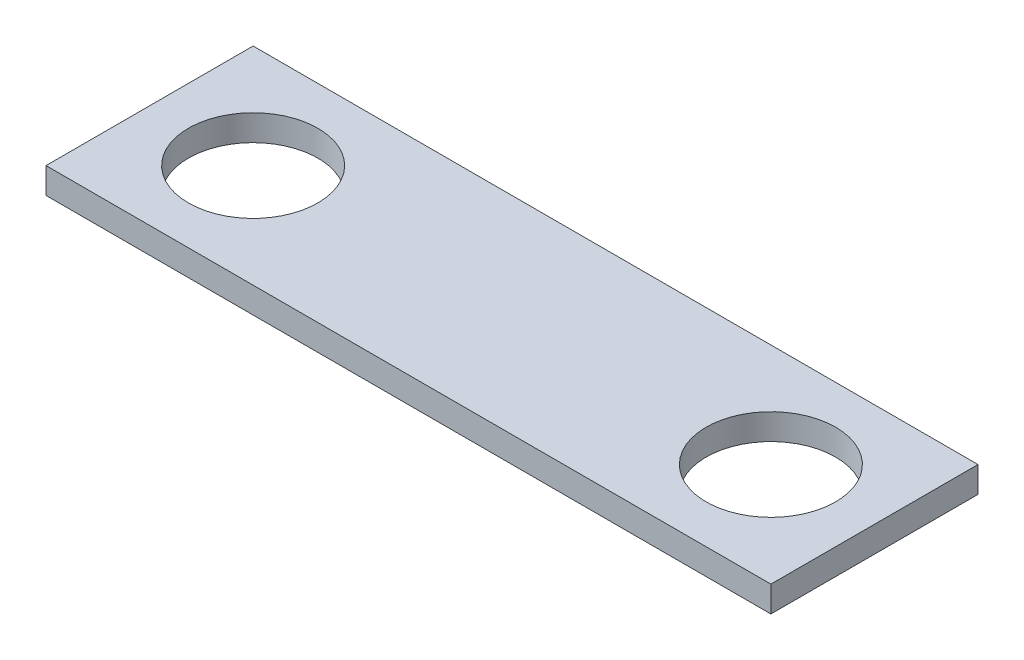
from build123d import *

# Parameters (mm, degrees)
SKETCH_1_W          = 14
SKETCH_1_H          = 4
EXTRUDE_1_DEPTH     = 0.5
SKETCH_2_R          = 1.25
CUT_EXTRUDE_1_DEPTH = 15.568802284


with BuildPart() as part:
    # Sketch 1 → Extrude 1 (new body)
    with BuildSketch(Plane(origin=(0, 0, 0), x_dir=(1, 0, 0), z_dir=(0, 1, 0))):
        with Locations((7, 2)):
            Rectangle(SKETCH_1_W, SKETCH_1_H)
    extrude(amount=EXTRUDE_1_DEPTH)

    # Sketch 2 → Cut-Extrude 1 (cut, through all)
    with BuildSketch(Plane(origin=(0, 0.5, 0), x_dir=(1, 0, 0), z_dir=(0, 1, 0))):
        with Locations(Location((2, 2, 0), (0, 0, 270))):
            Circle(SKETCH_2_R)
        with Locations(Location((12, 2, 0), (0, 0, 90))):
            Circle(SKETCH_2_R)
    extrude(amount=-CUT_EXTRUDE_1_DEPTH, mode=Mode.SUBTRACT)


solid = part.part
